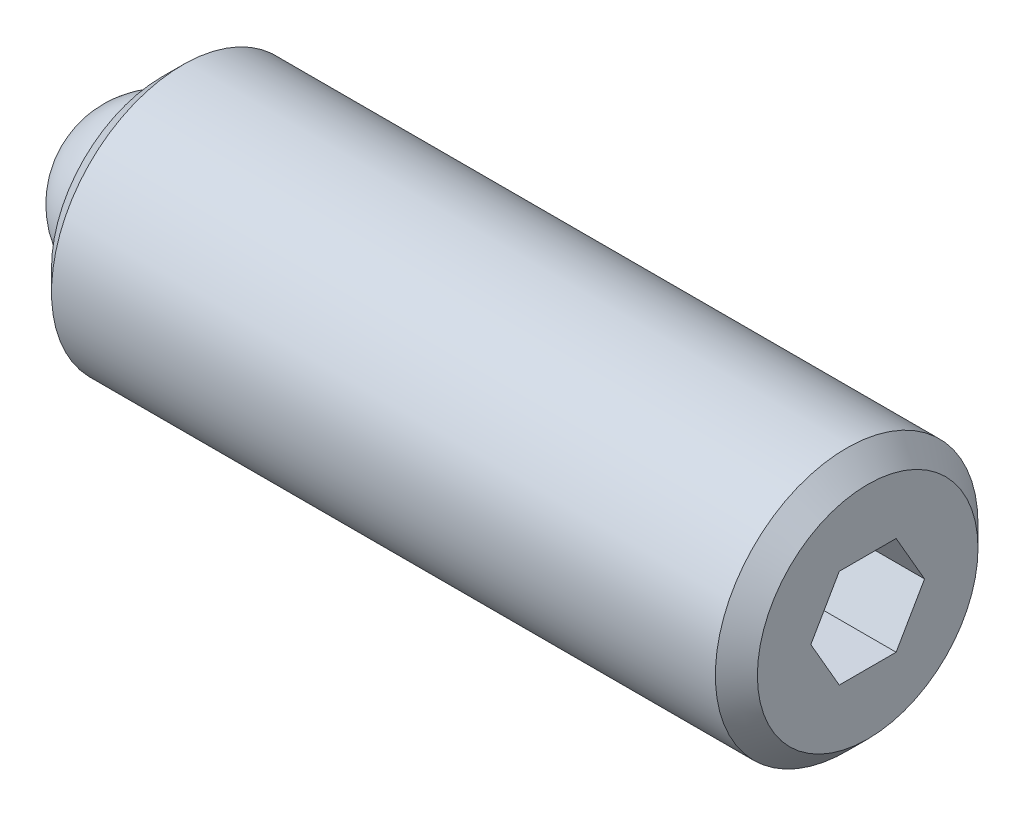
ISO-10303-21;
HEADER;
FILE_DESCRIPTION(('STEP AP214'),'2;1');
FILE_NAME('part.step','',(''),(''),'','','');
FILE_SCHEMA(('AUTOMOTIVE_DESIGN { 1 0 10303 214 1 1 1 1 }'));
ENDSEC;
DATA;
#1=APPLICATION_CONTEXT('core data for automotive mechanical design processes');
#2=APPLICATION_PROTOCOL_DEFINITION('international standard','automotive_design',2000,#1);
#3=PRODUCT_CONTEXT('',#1,'mechanical');
#4=PRODUCT('Part','Part','',(#3));
#5=PRODUCT_RELATED_PRODUCT_CATEGORY('part','',(#4));
#6=PRODUCT_DEFINITION_FORMATION('','',#4);
#7=PRODUCT_DEFINITION_CONTEXT('part definition',#1,'design');
#8=PRODUCT_DEFINITION('design','',#6,#7);
#9=PRODUCT_DEFINITION_SHAPE('','',#8);
#10=(LENGTH_UNIT() NAMED_UNIT(*) SI_UNIT(.MILLI.,.METRE.));
#11=(NAMED_UNIT(*) PLANE_ANGLE_UNIT() SI_UNIT($,.RADIAN.));
#12=(NAMED_UNIT(*) SI_UNIT($,.STERADIAN.) SOLID_ANGLE_UNIT());
#13=UNCERTAINTY_MEASURE_WITH_UNIT(LENGTH_MEASURE(1.E-05),#10,'distance_accuracy_value','');
#14=(GEOMETRIC_REPRESENTATION_CONTEXT(3) GLOBAL_UNCERTAINTY_ASSIGNED_CONTEXT((#13)) GLOBAL_UNIT_ASSIGNED_CONTEXT((#10,
#11,#12)) REPRESENTATION_CONTEXT('',''));
#15=CARTESIAN_POINT('',(0.,0.,0.));
#16=DIRECTION('',(0.,0.,1.));
#17=DIRECTION('',(1.,0.,0.));
#18=AXIS2_PLACEMENT_3D('',#15,#16,#17);
#19=CARTESIAN_POINT('',(0.,0.,0.));
#20=DIRECTION('',(0.,-1.,0.));
#21=DIRECTION('',(0.,0.,1.));
#22=AXIS2_PLACEMENT_3D('',#19,#20,#21);
#23=SPHERICAL_SURFACE('',#22,1.984375);
#24=CARTESIAN_POINT('',(0.,-1.984375,0.));
#25=VERTEX_POINT('',#24);
#26=VERTEX_LOOP('',#25);
#27=FACE_BOUND('',#26,.T.);
#28=ADVANCED_FACE('F43',(#27),#23,.T.);
#29=CLOSED_SHELL('',(#28));
#30=MANIFOLD_SOLID_BREP('B2',#29);
#31=CARTESIAN_POINT('',(17.065625,0.,0.));
#32=DIRECTION('',(-1.,0.,0.));
#33=DIRECTION('',(0.,0.,1.));
#34=AXIS2_PLACEMENT_3D('',#31,#32,#33);
#35=CYLINDRICAL_SURFACE('',#34,3.175);
#36=CARTESIAN_POINT('',(16.557625,0.,0.));
#37=DIRECTION('',(1.,0.,0.));
#38=DIRECTION('',(0.,0.,-1.));
#39=AXIS2_PLACEMENT_3D('',#36,#37,#38);
#40=CIRCLE('',#39,3.175);
#41=CARTESIAN_POINT('',(16.557625,0.,-3.175));
#42=VERTEX_POINT('',#41);
#43=EDGE_CURVE('E41',#42,#42,#40,.F.);
#44=ORIENTED_EDGE('',*,*,#43,.T.);
#45=EDGE_LOOP('',(#44));
#46=FACE_BOUND('',#45,.T.);
#47=CARTESIAN_POINT('',(0.508000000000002,0.,0.));
#48=DIRECTION('',(1.,0.,0.));
#49=DIRECTION('',(0.,0.,-1.));
#50=AXIS2_PLACEMENT_3D('',#47,#48,#49);
#51=CIRCLE('',#50,3.175);
#52=CARTESIAN_POINT('',(0.508000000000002,0.,-3.175));
#53=VERTEX_POINT('',#52);
#54=EDGE_CURVE('E159',#53,#53,#51,.T.);
#55=ORIENTED_EDGE('',*,*,#54,.T.);
#56=EDGE_LOOP('',(#55));
#57=FACE_BOUND('',#56,.T.);
#58=ADVANCED_FACE('F56',(#46,#57),#35,.T.);
#59=CARTESIAN_POINT('',(17.065625,0.,0.));
#60=DIRECTION('',(1.,0.,0.));
#61=DIRECTION('',(0.,0.,-1.));
#62=AXIS2_PLACEMENT_3D('',#59,#60,#61);
#63=PLANE('',#62);
#64=DIRECTION('',(0.,0.866025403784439,-0.5));
#65=VECTOR('',#64,1.);
#66=CARTESIAN_POINT('',(17.065625,-1.190625,-0.687407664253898));
#67=LINE('',#66,#65);
#68=CARTESIAN_POINT('',(17.065625,-1.190625,-0.687407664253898));
#69=VERTEX_POINT('',#68);
#70=CARTESIAN_POINT('',(17.065625,0.,-1.3748153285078));
#71=VERTEX_POINT('',#70);
#72=EDGE_CURVE('E71',#69,#71,#67,.T.);
#73=ORIENTED_EDGE('',*,*,#72,.F.);
#74=DIRECTION('',(0.,0.,-1.));
#75=VECTOR('',#74,1.);
#76=CARTESIAN_POINT('',(17.065625,-1.190625,0.687407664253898));
#77=LINE('',#76,#75);
#78=CARTESIAN_POINT('',(17.065625,-1.190625,0.687407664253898));
#79=VERTEX_POINT('',#78);
#80=EDGE_CURVE('E155',#79,#69,#77,.T.);
#81=ORIENTED_EDGE('',*,*,#80,.F.);
#82=DIRECTION('',(0.,-0.866025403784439,-0.5));
#83=VECTOR('',#82,1.);
#84=CARTESIAN_POINT('',(17.065625,0.,1.3748153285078));
#85=LINE('',#84,#83);
#86=CARTESIAN_POINT('',(17.065625,0.,1.3748153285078));
#87=VERTEX_POINT('',#86);
#88=EDGE_CURVE('E153',#87,#79,#85,.T.);
#89=ORIENTED_EDGE('',*,*,#88,.F.);
#90=DIRECTION('',(0.,-0.866025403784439,0.5));
#91=VECTOR('',#90,1.);
#92=CARTESIAN_POINT('',(17.065625,1.190625,0.687407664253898));
#93=LINE('',#92,#91);
#94=CARTESIAN_POINT('',(17.065625,1.190625,0.687407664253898));
#95=VERTEX_POINT('',#94);
#96=EDGE_CURVE('E119',#95,#87,#93,.T.);
#97=ORIENTED_EDGE('',*,*,#96,.F.);
#98=DIRECTION('',(0.,0.,1.));
#99=VECTOR('',#98,1.);
#100=CARTESIAN_POINT('',(17.065625,1.190625,-0.687407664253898));
#101=LINE('',#100,#99);
#102=CARTESIAN_POINT('',(17.065625,1.190625,-0.687407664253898));
#103=VERTEX_POINT('',#102);
#104=EDGE_CURVE('E149',#103,#95,#101,.T.);
#105=ORIENTED_EDGE('',*,*,#104,.F.);
#106=DIRECTION('',(0.,0.866025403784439,0.5));
#107=VECTOR('',#106,1.);
#108=CARTESIAN_POINT('',(17.065625,0.,-1.3748153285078));
#109=LINE('',#108,#107);
#110=EDGE_CURVE('E145',#71,#103,#109,.T.);
#111=ORIENTED_EDGE('',*,*,#110,.F.);
#112=EDGE_LOOP('',(#73,#81,#89,#97,#105,#111));
#113=FACE_BOUND('',#112,.T.);
#114=CARTESIAN_POINT('',(17.065625,0.,0.));
#115=DIRECTION('',(1.,0.,0.));
#116=DIRECTION('',(0.,0.,-1.));
#117=AXIS2_PLACEMENT_3D('',#114,#115,#116);
#118=CIRCLE('',#117,2.667);
#119=CARTESIAN_POINT('',(17.065625,0.,-2.667));
#120=VERTEX_POINT('',#119);
#121=EDGE_CURVE('E64',#120,#120,#118,.T.);
#122=ORIENTED_EDGE('',*,*,#121,.T.);
#123=EDGE_LOOP('',(#122));
#124=FACE_BOUND('',#123,.T.);
#125=ADVANCED_FACE('F172',(#113,#124),#63,.T.);
#126=CARTESIAN_POINT('',(0.,0.,0.));
#127=DIRECTION('',(1.,0.,0.));
#128=DIRECTION('',(0.,0.,-1.));
#129=AXIS2_PLACEMENT_3D('',#126,#127,#128);
#130=PLANE('',#129);
#131=CARTESIAN_POINT('',(0.,0.,0.));
#132=DIRECTION('',(-1.,0.,0.));
#133=DIRECTION('',(0.,0.,1.));
#134=AXIS2_PLACEMENT_3D('',#131,#132,#133);
#135=CIRCLE('',#134,1.9812);
#136=CARTESIAN_POINT('',(0.,0.,1.9812));
#137=VERTEX_POINT('',#136);
#138=EDGE_CURVE('E227',#137,#137,#135,.T.);
#139=ORIENTED_EDGE('',*,*,#138,.F.);
#140=EDGE_LOOP('',(#139));
#141=FACE_BOUND('',#140,.T.);
#142=CARTESIAN_POINT('',(0.,0.,0.));
#143=DIRECTION('',(1.,0.,0.));
#144=DIRECTION('',(0.,0.,-1.));
#145=AXIS2_PLACEMENT_3D('',#142,#143,#144);
#146=CIRCLE('',#145,2.667);
#147=CARTESIAN_POINT('',(0.,0.,-2.667));
#148=VERTEX_POINT('',#147);
#149=EDGE_CURVE('E167',#148,#148,#146,.F.);
#150=ORIENTED_EDGE('',*,*,#149,.T.);
#151=EDGE_LOOP('',(#150));
#152=FACE_BOUND('',#151,.T.);
#153=ADVANCED_FACE('F184',(#141,#152),#130,.F.);
#154=CARTESIAN_POINT('',(0.508000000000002,0.,0.));
#155=DIRECTION('',(1.,0.,0.));
#156=DIRECTION('',(0.,0.,-1.));
#157=AXIS2_PLACEMENT_3D('',#154,#155,#156);
#158=CONICAL_SURFACE('',#157,3.175,0.785398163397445);
#159=ORIENTED_EDGE('',*,*,#149,.F.);
#160=EDGE_LOOP('',(#159));
#161=FACE_BOUND('',#160,.T.);
#162=ORIENTED_EDGE('',*,*,#54,.F.);
#163=EDGE_LOOP('',(#162));
#164=FACE_BOUND('',#163,.T.);
#165=ADVANCED_FACE('F176',(#161,#164),#158,.T.);
#166=CARTESIAN_POINT('',(17.065625,0.,0.));
#167=DIRECTION('',(-1.,0.,0.));
#168=DIRECTION('',(0.,0.,1.));
#169=AXIS2_PLACEMENT_3D('',#166,#167,#168);
#170=CONICAL_SURFACE('',#169,2.667,0.785398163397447);
#171=ORIENTED_EDGE('',*,*,#43,.F.);
#172=EDGE_LOOP('',(#171));
#173=FACE_BOUND('',#172,.T.);
#174=ORIENTED_EDGE('',*,*,#121,.F.);
#175=EDGE_LOOP('',(#174));
#176=FACE_BOUND('',#175,.T.);
#177=ADVANCED_FACE('F58',(#173,#176),#170,.T.);
#178=CARTESIAN_POINT('',(14.779625,-1.190625,-0.687407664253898));
#179=DIRECTION('',(0.,-0.5,-0.866025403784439));
#180=DIRECTION('',(0.,0.866025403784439,-0.5));
#181=AXIS2_PLACEMENT_3D('',#178,#179,#180);
#182=PLANE('',#181);
#183=ORIENTED_EDGE('',*,*,#72,.T.);
#184=DIRECTION('',(1.,0.,0.));
#185=VECTOR('',#184,1.);
#186=CARTESIAN_POINT('',(14.779625,0.,-1.3748153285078));
#187=LINE('',#186,#185);
#188=CARTESIAN_POINT('',(14.779625,0.,-1.3748153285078));
#189=VERTEX_POINT('',#188);
#190=EDGE_CURVE('E101',#189,#71,#187,.T.);
#191=ORIENTED_EDGE('',*,*,#190,.F.);
#192=DIRECTION('',(0.,0.866025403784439,-0.5));
#193=VECTOR('',#192,1.);
#194=CARTESIAN_POINT('',(14.779625,-1.190625,-0.687407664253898));
#195=LINE('',#194,#193);
#196=CARTESIAN_POINT('',(14.779625,-1.190625,-0.687407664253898));
#197=VERTEX_POINT('',#196);
#198=EDGE_CURVE('E157',#197,#189,#195,.T.);
#199=ORIENTED_EDGE('',*,*,#198,.F.);
#200=DIRECTION('',(1.,0.,0.));
#201=VECTOR('',#200,1.);
#202=CARTESIAN_POINT('',(14.779625,-1.190625,-0.687407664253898));
#203=LINE('',#202,#201);
#204=EDGE_CURVE('E79',#197,#69,#203,.T.);
#205=ORIENTED_EDGE('',*,*,#204,.T.);
#206=EDGE_LOOP('',(#183,#191,#199,#205));
#207=FACE_BOUND('',#206,.T.);
#208=ADVANCED_FACE('F175',(#207),#182,.F.);
#209=CARTESIAN_POINT('',(14.779625,-1.190625,0.687407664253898));
#210=DIRECTION('',(0.,-1.,0.));
#211=DIRECTION('',(0.,0.,-1.));
#212=AXIS2_PLACEMENT_3D('',#209,#210,#211);
#213=PLANE('',#212);
#214=ORIENTED_EDGE('',*,*,#80,.T.);
#215=ORIENTED_EDGE('',*,*,#204,.F.);
#216=DIRECTION('',(0.,0.,-1.));
#217=VECTOR('',#216,1.);
#218=CARTESIAN_POINT('',(14.779625,-1.190625,0.687407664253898));
#219=LINE('',#218,#217);
#220=CARTESIAN_POINT('',(14.779625,-1.190625,0.687407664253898));
#221=VERTEX_POINT('',#220);
#222=EDGE_CURVE('E131',#221,#197,#219,.T.);
#223=ORIENTED_EDGE('',*,*,#222,.F.);
#224=DIRECTION('',(1.,0.,0.));
#225=VECTOR('',#224,1.);
#226=CARTESIAN_POINT('',(14.779625,-1.190625,0.687407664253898));
#227=LINE('',#226,#225);
#228=EDGE_CURVE('E123',#221,#79,#227,.T.);
#229=ORIENTED_EDGE('',*,*,#228,.T.);
#230=EDGE_LOOP('',(#214,#215,#223,#229));
#231=FACE_BOUND('',#230,.T.);
#232=ADVANCED_FACE('F182',(#231),#213,.F.);
#233=CARTESIAN_POINT('',(14.779625,0.,1.3748153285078));
#234=DIRECTION('',(0.,-0.5,0.866025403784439));
#235=DIRECTION('',(0.,-0.866025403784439,-0.5));
#236=AXIS2_PLACEMENT_3D('',#233,#234,#235);
#237=PLANE('',#236);
#238=ORIENTED_EDGE('',*,*,#88,.T.);
#239=ORIENTED_EDGE('',*,*,#228,.F.);
#240=DIRECTION('',(0.,-0.866025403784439,-0.5));
#241=VECTOR('',#240,1.);
#242=CARTESIAN_POINT('',(14.779625,0.,1.3748153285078));
#243=LINE('',#242,#241);
#244=CARTESIAN_POINT('',(14.779625,0.,1.3748153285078));
#245=VERTEX_POINT('',#244);
#246=EDGE_CURVE('E127',#245,#221,#243,.T.);
#247=ORIENTED_EDGE('',*,*,#246,.F.);
#248=DIRECTION('',(1.,0.,0.));
#249=VECTOR('',#248,1.);
#250=CARTESIAN_POINT('',(14.779625,0.,1.3748153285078));
#251=LINE('',#250,#249);
#252=EDGE_CURVE('E112',#245,#87,#251,.T.);
#253=ORIENTED_EDGE('',*,*,#252,.T.);
#254=EDGE_LOOP('',(#238,#239,#247,#253));
#255=FACE_BOUND('',#254,.T.);
#256=ADVANCED_FACE('F128',(#255),#237,.F.);
#257=CARTESIAN_POINT('',(14.779625,1.190625,0.687407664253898));
#258=DIRECTION('',(0.,0.5,0.866025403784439));
#259=DIRECTION('',(0.,-0.866025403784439,0.5));
#260=AXIS2_PLACEMENT_3D('',#257,#258,#259);
#261=PLANE('',#260);
#262=ORIENTED_EDGE('',*,*,#96,.T.);
#263=ORIENTED_EDGE('',*,*,#252,.F.);
#264=DIRECTION('',(0.,-0.866025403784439,0.5));
#265=VECTOR('',#264,1.);
#266=CARTESIAN_POINT('',(14.779625,1.190625,0.687407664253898));
#267=LINE('',#266,#265);
#268=CARTESIAN_POINT('',(14.779625,1.190625,0.687407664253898));
#269=VERTEX_POINT('',#268);
#270=EDGE_CURVE('E116',#269,#245,#267,.T.);
#271=ORIENTED_EDGE('',*,*,#270,.F.);
#272=DIRECTION('',(1.,0.,0.));
#273=VECTOR('',#272,1.);
#274=CARTESIAN_POINT('',(14.779625,1.190625,0.687407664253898));
#275=LINE('',#274,#273);
#276=EDGE_CURVE('E124',#269,#95,#275,.T.);
#277=ORIENTED_EDGE('',*,*,#276,.T.);
#278=EDGE_LOOP('',(#262,#263,#271,#277));
#279=FACE_BOUND('',#278,.T.);
#280=ADVANCED_FACE('F114',(#279),#261,.F.);
#281=CARTESIAN_POINT('',(14.779625,1.190625,-0.687407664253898));
#282=DIRECTION('',(0.,1.,0.));
#283=DIRECTION('',(0.,0.,1.));
#284=AXIS2_PLACEMENT_3D('',#281,#282,#283);
#285=PLANE('',#284);
#286=ORIENTED_EDGE('',*,*,#104,.T.);
#287=ORIENTED_EDGE('',*,*,#276,.F.);
#288=DIRECTION('',(0.,0.,1.));
#289=VECTOR('',#288,1.);
#290=CARTESIAN_POINT('',(14.779625,1.190625,-0.687407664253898));
#291=LINE('',#290,#289);
#292=CARTESIAN_POINT('',(14.779625,1.190625,-0.687407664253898));
#293=VERTEX_POINT('',#292);
#294=EDGE_CURVE('E137',#293,#269,#291,.T.);
#295=ORIENTED_EDGE('',*,*,#294,.F.);
#296=DIRECTION('',(1.,0.,0.));
#297=VECTOR('',#296,1.);
#298=CARTESIAN_POINT('',(14.779625,1.190625,-0.687407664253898));
#299=LINE('',#298,#297);
#300=EDGE_CURVE('E162',#293,#103,#299,.T.);
#301=ORIENTED_EDGE('',*,*,#300,.T.);
#302=EDGE_LOOP('',(#286,#287,#295,#301));
#303=FACE_BOUND('',#302,.T.);
#304=ADVANCED_FACE('F203',(#303),#285,.F.);
#305=CARTESIAN_POINT('',(14.779625,0.,-1.3748153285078));
#306=DIRECTION('',(0.,0.5,-0.866025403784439));
#307=DIRECTION('',(0.,0.866025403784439,0.5));
#308=AXIS2_PLACEMENT_3D('',#305,#306,#307);
#309=PLANE('',#308);
#310=ORIENTED_EDGE('',*,*,#110,.T.);
#311=ORIENTED_EDGE('',*,*,#300,.F.);
#312=DIRECTION('',(0.,0.866025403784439,0.5));
#313=VECTOR('',#312,1.);
#314=CARTESIAN_POINT('',(14.779625,0.,-1.3748153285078));
#315=LINE('',#314,#313);
#316=EDGE_CURVE('E139',#189,#293,#315,.T.);
#317=ORIENTED_EDGE('',*,*,#316,.F.);
#318=ORIENTED_EDGE('',*,*,#190,.T.);
#319=EDGE_LOOP('',(#310,#311,#317,#318));
#320=FACE_BOUND('',#319,.T.);
#321=ADVANCED_FACE('F200',(#320),#309,.F.);
#322=CARTESIAN_POINT('',(14.779625,0.,0.));
#323=DIRECTION('',(1.,0.,0.));
#324=DIRECTION('',(0.,0.,-1.));
#325=AXIS2_PLACEMENT_3D('',#322,#323,#324);
#326=PLANE('',#325);
#327=ORIENTED_EDGE('',*,*,#198,.T.);
#328=ORIENTED_EDGE('',*,*,#316,.T.);
#329=ORIENTED_EDGE('',*,*,#294,.T.);
#330=ORIENTED_EDGE('',*,*,#270,.T.);
#331=ORIENTED_EDGE('',*,*,#246,.T.);
#332=ORIENTED_EDGE('',*,*,#222,.T.);
#333=EDGE_LOOP('',(#327,#328,#329,#330,#331,#332));
#334=FACE_BOUND('',#333,.T.);
#335=ADVANCED_FACE('F134',(#334),#326,.T.);
#336=CARTESIAN_POINT('',(1.984375,0.,0.));
#337=DIRECTION('',(-1.,0.,0.));
#338=DIRECTION('',(0.,0.,1.));
#339=AXIS2_PLACEMENT_3D('',#336,#337,#338);
#340=CYLINDRICAL_SURFACE('',#339,1.9812);
#341=CARTESIAN_POINT('',(1.984375,0.,0.));
#342=DIRECTION('',(-1.,0.,0.));
#343=DIRECTION('',(0.,0.,1.));
#344=AXIS2_PLACEMENT_3D('',#341,#342,#343);
#345=CIRCLE('',#344,1.9812);
#346=CARTESIAN_POINT('',(1.984375,0.,1.9812));
#347=VERTEX_POINT('',#346);
#348=EDGE_CURVE('E146',#347,#347,#345,.T.);
#349=ORIENTED_EDGE('',*,*,#348,.F.);
#350=EDGE_LOOP('',(#349));
#351=FACE_BOUND('',#350,.T.);
#352=ORIENTED_EDGE('',*,*,#138,.T.);
#353=EDGE_LOOP('',(#352));
#354=FACE_BOUND('',#353,.T.);
#355=ADVANCED_FACE('F216',(#351,#354),#340,.F.);
#356=CARTESIAN_POINT('',(1.984375,0.,0.));
#357=DIRECTION('',(-1.,0.,0.));
#358=DIRECTION('',(0.,0.,1.));
#359=AXIS2_PLACEMENT_3D('',#356,#357,#358);
#360=PLANE('',#359);
#361=ORIENTED_EDGE('',*,*,#348,.T.);
#362=EDGE_LOOP('',(#361));
#363=FACE_BOUND('',#362,.T.);
#364=ADVANCED_FACE('F219',(#363),#360,.T.);
#365=CLOSED_SHELL('',(#58,#125,#153,#165,#177,#208,#232,#256,#280,#304,#321,#335,#355,#364));
#366=MANIFOLD_SOLID_BREP('B6',#365);
#367=ADVANCED_BREP_SHAPE_REPRESENTATION('',(#18,#30,#366),#14);
#368=SHAPE_DEFINITION_REPRESENTATION(#9,#367);
ENDSEC;
END-ISO-10303-21;
